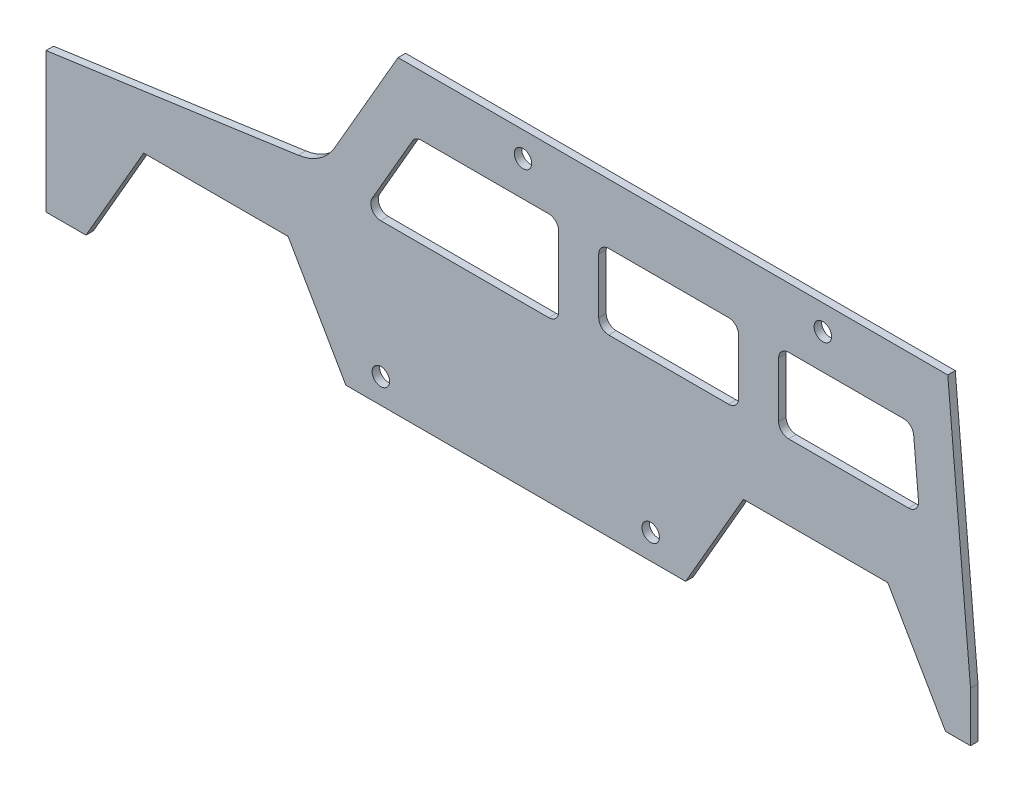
ISO-10303-21;
HEADER;
FILE_DESCRIPTION(('STEP AP214'),'2;1');
FILE_NAME('part.step','',(''),(''),'','','');
FILE_SCHEMA(('AUTOMOTIVE_DESIGN { 1 0 10303 214 1 1 1 1 }'));
ENDSEC;
DATA;
#1=APPLICATION_CONTEXT('core data for automotive mechanical design processes');
#2=APPLICATION_PROTOCOL_DEFINITION('international standard','automotive_design',2000,#1);
#3=PRODUCT_CONTEXT('',#1,'mechanical');
#4=PRODUCT('Part','Part','',(#3));
#5=PRODUCT_RELATED_PRODUCT_CATEGORY('part','',(#4));
#6=PRODUCT_DEFINITION_FORMATION('','',#4);
#7=PRODUCT_DEFINITION_CONTEXT('part definition',#1,'design');
#8=PRODUCT_DEFINITION('design','',#6,#7);
#9=PRODUCT_DEFINITION_SHAPE('','',#8);
#10=(LENGTH_UNIT() NAMED_UNIT(*) SI_UNIT(.MILLI.,.METRE.));
#11=(NAMED_UNIT(*) PLANE_ANGLE_UNIT() SI_UNIT($,.RADIAN.));
#12=(NAMED_UNIT(*) SI_UNIT($,.STERADIAN.) SOLID_ANGLE_UNIT());
#13=UNCERTAINTY_MEASURE_WITH_UNIT(LENGTH_MEASURE(1.E-05),#10,'distance_accuracy_value','');
#14=(GEOMETRIC_REPRESENTATION_CONTEXT(3) GLOBAL_UNCERTAINTY_ASSIGNED_CONTEXT((#13)) GLOBAL_UNIT_ASSIGNED_CONTEXT((#10,
#11,#12)) REPRESENTATION_CONTEXT('',''));
#15=CARTESIAN_POINT('',(0.,0.,0.));
#16=DIRECTION('',(0.,0.,1.));
#17=DIRECTION('',(1.,0.,0.));
#18=AXIS2_PLACEMENT_3D('',#15,#16,#17);
#19=CARTESIAN_POINT('',(49.0868907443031,44.9969883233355,1.5));
#20=DIRECTION('',(0.,0.,1.));
#21=DIRECTION('',(1.,0.,0.));
#22=AXIS2_PLACEMENT_3D('',#19,#20,#21);
#23=PLANE('',#22);
#24=DIRECTION('',(-1.,0.,0.));
#25=VECTOR('',#24,1.);
#26=CARTESIAN_POINT('',(112.599607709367,50.,1.5));
#27=LINE('',#26,#25);
#28=CARTESIAN_POINT('',(136.599607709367,50.,1.5));
#29=VERTEX_POINT('',#28);
#30=CARTESIAN_POINT('',(112.599607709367,50.,1.5));
#31=VERTEX_POINT('',#30);
#32=EDGE_CURVE('E373',#29,#31,#27,.T.);
#33=ORIENTED_EDGE('',*,*,#32,.F.);
#34=CARTESIAN_POINT('',(136.599607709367,48.,1.5));
#35=DIRECTION('',(0.,0.,1.));
#36=DIRECTION('',(1.,0.,0.));
#37=AXIS2_PLACEMENT_3D('',#34,#35,#36);
#38=CIRCLE('',#37,2.00000000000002);
#39=CARTESIAN_POINT('',(138.599607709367,48.,1.5));
#40=VERTEX_POINT('',#39);
#41=EDGE_CURVE('E371',#40,#29,#38,.T.);
#42=ORIENTED_EDGE('',*,*,#41,.F.);
#43=DIRECTION('',(0.,1.,0.));
#44=VECTOR('',#43,1.);
#45=CARTESIAN_POINT('',(138.599607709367,48.,1.5));
#46=LINE('',#45,#44);
#47=CARTESIAN_POINT('',(138.599607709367,37.,1.5));
#48=VERTEX_POINT('',#47);
#49=EDGE_CURVE('E387',#48,#40,#46,.T.);
#50=ORIENTED_EDGE('',*,*,#49,.F.);
#51=CARTESIAN_POINT('',(136.599607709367,37.,1.5));
#52=DIRECTION('',(0.,0.,1.));
#53=DIRECTION('',(1.,0.,0.));
#54=AXIS2_PLACEMENT_3D('',#51,#52,#53);
#55=CIRCLE('',#54,2.);
#56=CARTESIAN_POINT('',(136.599607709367,35.,1.5));
#57=VERTEX_POINT('',#56);
#58=EDGE_CURVE('E384',#57,#48,#55,.T.);
#59=ORIENTED_EDGE('',*,*,#58,.F.);
#60=DIRECTION('',(1.,0.,0.));
#61=VECTOR('',#60,1.);
#62=CARTESIAN_POINT('',(112.599607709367,35.,1.5));
#63=LINE('',#62,#61);
#64=CARTESIAN_POINT('',(112.599607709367,35.,1.5));
#65=VERTEX_POINT('',#64);
#66=EDGE_CURVE('E382',#65,#57,#63,.T.);
#67=ORIENTED_EDGE('',*,*,#66,.F.);
#68=CARTESIAN_POINT('',(112.599607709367,37.,1.5));
#69=DIRECTION('',(0.,0.,1.));
#70=DIRECTION('',(1.,0.,0.));
#71=AXIS2_PLACEMENT_3D('',#68,#69,#70);
#72=CIRCLE('',#71,1.99999999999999);
#73=CARTESIAN_POINT('',(110.599607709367,37.,1.5));
#74=VERTEX_POINT('',#73);
#75=EDGE_CURVE('E380',#74,#65,#72,.T.);
#76=ORIENTED_EDGE('',*,*,#75,.F.);
#77=DIRECTION('',(0.,-1.,0.));
#78=VECTOR('',#77,1.);
#79=CARTESIAN_POINT('',(110.599607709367,48.,1.5));
#80=LINE('',#79,#78);
#81=CARTESIAN_POINT('',(110.599607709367,48.,1.5));
#82=VERTEX_POINT('',#81);
#83=EDGE_CURVE('E378',#82,#74,#80,.T.);
#84=ORIENTED_EDGE('',*,*,#83,.F.);
#85=CARTESIAN_POINT('',(112.599607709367,48.,1.5));
#86=DIRECTION('',(0.,0.,1.));
#87=DIRECTION('',(1.,0.,0.));
#88=AXIS2_PLACEMENT_3D('',#85,#86,#87);
#89=CIRCLE('',#88,2.);
#90=EDGE_CURVE('E376',#31,#82,#89,.T.);
#91=ORIENTED_EDGE('',*,*,#90,.F.);
#92=EDGE_LOOP('',(#33,#42,#50,#59,#67,#76,#84,#91));
#93=FACE_BOUND('',#92,.T.);
#94=CARTESIAN_POINT('',(155.450589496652,57.,1.5));
#95=DIRECTION('',(0.,0.,1.));
#96=DIRECTION('',(1.,0.,0.));
#97=AXIS2_PLACEMENT_3D('',#94,#95,#96);
#98=CIRCLE('',#97,1.75000000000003);
#99=CARTESIAN_POINT('',(157.200589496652,57.,1.5));
#100=VERTEX_POINT('',#99);
#101=EDGE_CURVE('E489',#100,#100,#98,.T.);
#102=ORIENTED_EDGE('',*,*,#101,.F.);
#103=EDGE_LOOP('',(#102));
#104=FACE_BOUND('',#103,.T.);
#105=CARTESIAN_POINT('',(67.,4.99999999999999,1.5));
#106=DIRECTION('',(0.,0.,1.));
#107=DIRECTION('',(1.,0.,0.));
#108=AXIS2_PLACEMENT_3D('',#105,#106,#107);
#109=CIRCLE('',#108,1.75);
#110=CARTESIAN_POINT('',(68.75,4.99999999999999,1.5));
#111=VERTEX_POINT('',#110);
#112=EDGE_CURVE('E501',#111,#111,#109,.T.);
#113=ORIENTED_EDGE('',*,*,#112,.F.);
#114=EDGE_LOOP('',(#113));
#115=FACE_BOUND('',#114,.T.);
#116=DIRECTION('',(0.,-1.,0.));
#117=VECTOR('',#116,1.);
#118=CARTESIAN_POINT('',(0.,28.,1.5));
#119=LINE('',#118,#117);
#120=CARTESIAN_POINT('',(0.,28.,1.5));
#121=VERTEX_POINT('',#120);
#122=CARTESIAN_POINT('',(0.,0.,1.5));
#123=VERTEX_POINT('',#122);
#124=EDGE_CURVE('E513',#121,#123,#119,.T.);
#125=ORIENTED_EDGE('',*,*,#124,.T.);
#126=DIRECTION('',(1.,0.,0.));
#127=VECTOR('',#126,1.);
#128=CARTESIAN_POINT('',(0.,0.,1.5));
#129=LINE('',#128,#127);
#130=CARTESIAN_POINT('',(8.,0.,1.5));
#131=VERTEX_POINT('',#130);
#132=EDGE_CURVE('E516',#123,#131,#129,.T.);
#133=ORIENTED_EDGE('',*,*,#132,.T.);
#134=DIRECTION('',(0.499999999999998,0.86602540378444,0.));
#135=VECTOR('',#134,1.);
#136=CARTESIAN_POINT('',(8.,0.,1.5));
#137=LINE('',#136,#135);
#138=CARTESIAN_POINT('',(19.5470053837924,20.,1.5));
#139=VERTEX_POINT('',#138);
#140=EDGE_CURVE('E519',#131,#139,#137,.T.);
#141=ORIENTED_EDGE('',*,*,#140,.T.);
#142=DIRECTION('',(1.,0.,0.));
#143=VECTOR('',#142,1.);
#144=CARTESIAN_POINT('',(19.5470053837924,20.,1.5));
#145=LINE('',#144,#143);
#146=CARTESIAN_POINT('',(48.4529946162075,20.,1.5));
#147=VERTEX_POINT('',#146);
#148=EDGE_CURVE('E521',#139,#147,#145,.T.);
#149=ORIENTED_EDGE('',*,*,#148,.T.);
#150=DIRECTION('',(0.499999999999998,-0.86602540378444,0.));
#151=VECTOR('',#150,1.);
#152=CARTESIAN_POINT('',(48.4529946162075,20.,1.5));
#153=LINE('',#152,#151);
#154=CARTESIAN_POINT('',(60.,0.,1.5));
#155=VERTEX_POINT('',#154);
#156=EDGE_CURVE('E523',#147,#155,#153,.T.);
#157=ORIENTED_EDGE('',*,*,#156,.T.);
#158=DIRECTION('',(1.,0.,0.));
#159=VECTOR('',#158,1.);
#160=CARTESIAN_POINT('',(60.,0.,1.5));
#161=LINE('',#160,#159);
#162=CARTESIAN_POINT('',(128.,0.,1.5));
#163=VERTEX_POINT('',#162);
#164=EDGE_CURVE('E525',#155,#163,#161,.T.);
#165=ORIENTED_EDGE('',*,*,#164,.T.);
#166=DIRECTION('',(0.499999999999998,0.86602540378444,0.));
#167=VECTOR('',#166,1.);
#168=CARTESIAN_POINT('',(128.,0.,1.5));
#169=LINE('',#168,#167);
#170=CARTESIAN_POINT('',(139.547005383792,20.,1.5));
#171=VERTEX_POINT('',#170);
#172=EDGE_CURVE('E527',#163,#171,#169,.T.);
#173=ORIENTED_EDGE('',*,*,#172,.T.);
#174=DIRECTION('',(1.,0.,0.));
#175=VECTOR('',#174,1.);
#176=CARTESIAN_POINT('',(139.547005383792,20.,1.5));
#177=LINE('',#176,#175);
#178=CARTESIAN_POINT('',(168.452994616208,20.,1.5));
#179=VERTEX_POINT('',#178);
#180=EDGE_CURVE('E529',#171,#179,#177,.T.);
#181=ORIENTED_EDGE('',*,*,#180,.T.);
#182=DIRECTION('',(0.499999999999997,-0.866025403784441,0.));
#183=VECTOR('',#182,1.);
#184=CARTESIAN_POINT('',(168.452994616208,20.,1.5));
#185=LINE('',#184,#183);
#186=CARTESIAN_POINT('',(180.,0.,1.5));
#187=VERTEX_POINT('',#186);
#188=EDGE_CURVE('E531',#179,#187,#185,.T.);
#189=ORIENTED_EDGE('',*,*,#188,.T.);
#190=DIRECTION('',(1.,0.,0.));
#191=VECTOR('',#190,1.);
#192=CARTESIAN_POINT('',(180.,0.,1.5));
#193=LINE('',#192,#191);
#194=CARTESIAN_POINT('',(185.,0.,1.5));
#195=VERTEX_POINT('',#194);
#196=EDGE_CURVE('E533',#187,#195,#193,.T.);
#197=ORIENTED_EDGE('',*,*,#196,.T.);
#198=DIRECTION('',(0.,1.,0.));
#199=VECTOR('',#198,1.);
#200=CARTESIAN_POINT('',(185.,0.,1.5));
#201=LINE('',#200,#199);
#202=CARTESIAN_POINT('',(185.,10.,1.5));
#203=VERTEX_POINT('',#202);
#204=EDGE_CURVE('E535',#195,#203,#201,.T.);
#205=ORIENTED_EDGE('',*,*,#204,.T.);
#206=DIRECTION('',(-0.0871557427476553,0.996194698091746,0.));
#207=VECTOR('',#206,1.);
#208=CARTESIAN_POINT('',(185.,10.,1.5));
#209=LINE('',#208,#207);
#210=CARTESIAN_POINT('',(180.450589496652,62.,1.5));
#211=VERTEX_POINT('',#210);
#212=EDGE_CURVE('E537',#203,#211,#209,.T.);
#213=ORIENTED_EDGE('',*,*,#212,.T.);
#214=DIRECTION('',(-1.,0.,0.));
#215=VECTOR('',#214,1.);
#216=CARTESIAN_POINT('',(180.450589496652,62.,1.5));
#217=LINE('',#216,#215);
#218=CARTESIAN_POINT('',(70.4505894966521,62.,1.5));
#219=VERTEX_POINT('',#218);
#220=EDGE_CURVE('E539',#211,#219,#217,.T.);
#221=ORIENTED_EDGE('',*,*,#220,.T.);
#222=DIRECTION('',(-0.499999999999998,-0.86602540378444,0.));
#223=VECTOR('',#222,1.);
#224=CARTESIAN_POINT('',(70.4505894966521,62.,1.5));
#225=LINE('',#224,#223);
#226=CARTESIAN_POINT('',(57.7471447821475,39.9969883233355,1.5));
#227=VERTEX_POINT('',#226);
#228=EDGE_CURVE('E541',#219,#227,#225,.T.);
#229=ORIENTED_EDGE('',*,*,#228,.T.);
#230=CARTESIAN_POINT('',(49.0868907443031,44.9969883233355,1.5));
#231=DIRECTION('',(0.,0.,-1.));
#232=DIRECTION('',(1.,0.,0.));
#233=AXIS2_PLACEMENT_3D('',#230,#231,#232);
#234=CIRCLE('',#233,9.99999999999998);
#235=CARTESIAN_POINT('',(50.4786217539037,35.0943076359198,1.5));
#236=VERTEX_POINT('',#235);
#237=EDGE_CURVE('E543',#227,#236,#234,.T.);
#238=ORIENTED_EDGE('',*,*,#237,.T.);
#239=DIRECTION('',(-0.990268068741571,-0.139173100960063,0.));
#240=VECTOR('',#239,1.);
#241=CARTESIAN_POINT('',(50.4786217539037,35.0943076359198,1.5));
#242=LINE('',#241,#240);
#243=EDGE_CURVE('E545',#236,#121,#242,.T.);
#244=ORIENTED_EDGE('',*,*,#243,.T.);
#245=EDGE_LOOP('',(#125,#133,#141,#149,#157,#165,#173,#181,#189,#197,#205,#213,#221,#229,#238,#244));
#246=FACE_BOUND('',#245,.T.);
#247=CARTESIAN_POINT('',(121.,5.,1.5));
#248=DIRECTION('',(0.,0.,1.));
#249=DIRECTION('',(1.,0.,0.));
#250=AXIS2_PLACEMENT_3D('',#247,#248,#249);
#251=CIRCLE('',#250,1.75000000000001);
#252=CARTESIAN_POINT('',(122.75,5.,1.5));
#253=VERTEX_POINT('',#252);
#254=EDGE_CURVE('E507',#253,#253,#251,.T.);
#255=ORIENTED_EDGE('',*,*,#254,.F.);
#256=EDGE_LOOP('',(#255));
#257=FACE_BOUND('',#256,.T.);
#258=CARTESIAN_POINT('',(95.4505894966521,57.,1.5));
#259=DIRECTION('',(0.,0.,1.));
#260=DIRECTION('',(1.,0.,0.));
#261=AXIS2_PLACEMENT_3D('',#258,#259,#260);
#262=CIRCLE('',#261,1.75000000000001);
#263=CARTESIAN_POINT('',(97.2005894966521,57.,1.5));
#264=VERTEX_POINT('',#263);
#265=EDGE_CURVE('E495',#264,#264,#262,.T.);
#266=ORIENTED_EDGE('',*,*,#265,.F.);
#267=EDGE_LOOP('',(#266));
#268=FACE_BOUND('',#267,.T.);
#269=DIRECTION('',(-1.,0.,0.));
#270=VECTOR('',#269,1.);
#271=CARTESIAN_POINT('',(148.599607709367,50.,1.5));
#272=LINE('',#271,#270);
#273=CARTESIAN_POINT('',(171.637232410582,50.,1.5));
#274=VERTEX_POINT('',#273);
#275=CARTESIAN_POINT('',(148.599607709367,50.,1.5));
#276=VERTEX_POINT('',#275);
#277=EDGE_CURVE('E432',#274,#276,#272,.T.);
#278=ORIENTED_EDGE('',*,*,#277,.F.);
#279=CARTESIAN_POINT('',(171.637232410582,48.,1.5));
#280=DIRECTION('',(0.,0.,1.));
#281=DIRECTION('',(1.,0.,0.));
#282=AXIS2_PLACEMENT_3D('',#279,#280,#281);
#283=CIRCLE('',#282,2.);
#284=CARTESIAN_POINT('',(173.629621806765,48.1743114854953,1.5));
#285=VERTEX_POINT('',#284);
#286=EDGE_CURVE('E430',#285,#274,#283,.T.);
#287=ORIENTED_EDGE('',*,*,#286,.F.);
#288=DIRECTION('',(-0.0871557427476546,0.996194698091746,0.));
#289=VECTOR('',#288,1.);
#290=CARTESIAN_POINT('',(173.629621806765,48.1743114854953,1.5));
#291=LINE('',#290,#289);
#292=CARTESIAN_POINT('',(174.59199710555,37.1743114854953,1.5));
#293=VERTEX_POINT('',#292);
#294=EDGE_CURVE('E446',#293,#285,#291,.T.);
#295=ORIENTED_EDGE('',*,*,#294,.F.);
#296=CARTESIAN_POINT('',(172.599607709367,37.,1.5));
#297=DIRECTION('',(0.,0.,1.));
#298=DIRECTION('',(1.,0.,0.));
#299=AXIS2_PLACEMENT_3D('',#296,#297,#298);
#300=CIRCLE('',#299,1.99999999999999);
#301=CARTESIAN_POINT('',(172.599607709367,35.,1.5));
#302=VERTEX_POINT('',#301);
#303=EDGE_CURVE('E443',#302,#293,#300,.T.);
#304=ORIENTED_EDGE('',*,*,#303,.F.);
#305=DIRECTION('',(1.,0.,0.));
#306=VECTOR('',#305,1.);
#307=CARTESIAN_POINT('',(148.599607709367,35.,1.5));
#308=LINE('',#307,#306);
#309=CARTESIAN_POINT('',(148.599607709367,35.,1.5));
#310=VERTEX_POINT('',#309);
#311=EDGE_CURVE('E441',#310,#302,#308,.T.);
#312=ORIENTED_EDGE('',*,*,#311,.F.);
#313=CARTESIAN_POINT('',(148.599607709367,37.,1.5));
#314=DIRECTION('',(0.,0.,1.));
#315=DIRECTION('',(1.,0.,0.));
#316=AXIS2_PLACEMENT_3D('',#313,#314,#315);
#317=CIRCLE('',#316,2.00000000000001);
#318=CARTESIAN_POINT('',(146.599607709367,37.,1.5));
#319=VERTEX_POINT('',#318);
#320=EDGE_CURVE('E439',#319,#310,#317,.T.);
#321=ORIENTED_EDGE('',*,*,#320,.F.);
#322=DIRECTION('',(0.,-1.,0.));
#323=VECTOR('',#322,1.);
#324=CARTESIAN_POINT('',(146.599607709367,48.,1.5));
#325=LINE('',#324,#323);
#326=CARTESIAN_POINT('',(146.599607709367,48.,1.5));
#327=VERTEX_POINT('',#326);
#328=EDGE_CURVE('E437',#327,#319,#325,.T.);
#329=ORIENTED_EDGE('',*,*,#328,.F.);
#330=CARTESIAN_POINT('',(148.599607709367,48.,1.5));
#331=DIRECTION('',(0.,0.,1.));
#332=DIRECTION('',(1.,0.,0.));
#333=AXIS2_PLACEMENT_3D('',#330,#331,#332);
#334=CIRCLE('',#333,2.);
#335=EDGE_CURVE('E435',#276,#327,#334,.T.);
#336=ORIENTED_EDGE('',*,*,#335,.F.);
#337=EDGE_LOOP('',(#278,#287,#295,#304,#312,#321,#329,#336));
#338=FACE_BOUND('',#337,.T.);
#339=DIRECTION('',(-1.,0.,0.));
#340=VECTOR('',#339,1.);
#341=CARTESIAN_POINT('',(75.0693916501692,50.,1.5));
#342=LINE('',#341,#340);
#343=CARTESIAN_POINT('',(100.599607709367,50.,1.5));
#344=VERTEX_POINT('',#343);
#345=CARTESIAN_POINT('',(75.0693916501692,50.,1.5));
#346=VERTEX_POINT('',#345);
#347=EDGE_CURVE('E314',#344,#346,#342,.T.);
#348=ORIENTED_EDGE('',*,*,#347,.F.);
#349=CARTESIAN_POINT('',(100.599607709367,48.,1.5));
#350=DIRECTION('',(0.,0.,1.));
#351=DIRECTION('',(1.,0.,0.));
#352=AXIS2_PLACEMENT_3D('',#349,#350,#351);
#353=CIRCLE('',#352,2.);
#354=CARTESIAN_POINT('',(102.599607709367,48.,1.5));
#355=VERTEX_POINT('',#354);
#356=EDGE_CURVE('E306',#355,#344,#353,.T.);
#357=ORIENTED_EDGE('',*,*,#356,.F.);
#358=DIRECTION('',(0.,1.,0.));
#359=VECTOR('',#358,1.);
#360=CARTESIAN_POINT('',(102.599607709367,48.,1.5));
#361=LINE('',#360,#359);
#362=CARTESIAN_POINT('',(102.599607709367,34.,1.5));
#363=VERTEX_POINT('',#362);
#364=EDGE_CURVE('E339',#363,#355,#361,.T.);
#365=ORIENTED_EDGE('',*,*,#364,.F.);
#366=CARTESIAN_POINT('',(100.599607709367,34.,1.5));
#367=DIRECTION('',(0.,0.,1.));
#368=DIRECTION('',(1.,0.,0.));
#369=AXIS2_PLACEMENT_3D('',#366,#367,#368);
#370=CIRCLE('',#369,1.99999999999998);
#371=CARTESIAN_POINT('',(100.599607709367,32.,1.5));
#372=VERTEX_POINT('',#371);
#373=EDGE_CURVE('E337',#372,#363,#370,.T.);
#374=ORIENTED_EDGE('',*,*,#373,.F.);
#375=DIRECTION('',(1.,0.,0.));
#376=VECTOR('',#375,1.);
#377=CARTESIAN_POINT('',(66.9864878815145,32.,1.5));
#378=LINE('',#377,#376);
#379=CARTESIAN_POINT('',(66.9864878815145,32.,1.5));
#380=VERTEX_POINT('',#379);
#381=EDGE_CURVE('E335',#380,#372,#378,.T.);
#382=ORIENTED_EDGE('',*,*,#381,.F.);
#383=CARTESIAN_POINT('',(66.9864878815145,34.,1.5));
#384=DIRECTION('',(0.,0.,1.));
#385=DIRECTION('',(1.,0.,0.));
#386=AXIS2_PLACEMENT_3D('',#383,#384,#385);
#387=CIRCLE('',#386,1.99999999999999);
#388=CARTESIAN_POINT('',(65.2544370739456,35.,1.5));
#389=VERTEX_POINT('',#388);
#390=EDGE_CURVE('E333',#389,#380,#387,.T.);
#391=ORIENTED_EDGE('',*,*,#390,.F.);
#392=DIRECTION('',(-0.499999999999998,-0.86602540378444,0.));
#393=VECTOR('',#392,1.);
#394=CARTESIAN_POINT('',(73.3373408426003,49.,1.5));
#395=LINE('',#394,#393);
#396=CARTESIAN_POINT('',(73.3373408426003,49.,1.5));
#397=VERTEX_POINT('',#396);
#398=EDGE_CURVE('E329',#397,#389,#395,.T.);
#399=ORIENTED_EDGE('',*,*,#398,.F.);
#400=CARTESIAN_POINT('',(75.0693916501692,48.,1.5));
#401=DIRECTION('',(0.,0.,1.));
#402=DIRECTION('',(1.,0.,0.));
#403=AXIS2_PLACEMENT_3D('',#400,#401,#402);
#404=CIRCLE('',#403,1.99999999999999);
#405=EDGE_CURVE('E327',#346,#397,#404,.T.);
#406=ORIENTED_EDGE('',*,*,#405,.F.);
#407=EDGE_LOOP('',(#348,#357,#365,#374,#382,#391,#399,#406));
#408=FACE_BOUND('',#407,.T.);
#409=ADVANCED_FACE('F49',(#93,#104,#115,#246,#257,#268,#338,#408),#23,.T.);
#410=CARTESIAN_POINT('',(49.0868907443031,44.9969883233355,0.));
#411=DIRECTION('',(0.,0.,1.));
#412=DIRECTION('',(1.,0.,0.));
#413=AXIS2_PLACEMENT_3D('',#410,#411,#412);
#414=PLANE('',#413);
#415=CARTESIAN_POINT('',(136.599607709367,48.,0.));
#416=DIRECTION('',(0.,0.,1.));
#417=DIRECTION('',(1.,0.,0.));
#418=AXIS2_PLACEMENT_3D('',#415,#416,#417);
#419=CIRCLE('',#418,2.00000000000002);
#420=CARTESIAN_POINT('',(138.599607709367,48.,0.));
#421=VERTEX_POINT('',#420);
#422=CARTESIAN_POINT('',(136.599607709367,50.,0.));
#423=VERTEX_POINT('',#422);
#424=EDGE_CURVE('E322',#421,#423,#419,.T.);
#425=ORIENTED_EDGE('',*,*,#424,.T.);
#426=DIRECTION('',(-1.,0.,0.));
#427=VECTOR('',#426,1.);
#428=CARTESIAN_POINT('',(112.599607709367,50.,0.));
#429=LINE('',#428,#427);
#430=CARTESIAN_POINT('',(112.599607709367,50.,0.));
#431=VERTEX_POINT('',#430);
#432=EDGE_CURVE('E392',#423,#431,#429,.T.);
#433=ORIENTED_EDGE('',*,*,#432,.T.);
#434=CARTESIAN_POINT('',(112.599607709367,48.,0.));
#435=DIRECTION('',(0.,0.,1.));
#436=DIRECTION('',(1.,0.,0.));
#437=AXIS2_PLACEMENT_3D('',#434,#435,#436);
#438=CIRCLE('',#437,2.);
#439=CARTESIAN_POINT('',(110.599607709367,48.,0.));
#440=VERTEX_POINT('',#439);
#441=EDGE_CURVE('E395',#431,#440,#438,.T.);
#442=ORIENTED_EDGE('',*,*,#441,.T.);
#443=DIRECTION('',(0.,-1.,0.));
#444=VECTOR('',#443,1.);
#445=CARTESIAN_POINT('',(110.599607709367,48.,0.));
#446=LINE('',#445,#444);
#447=CARTESIAN_POINT('',(110.599607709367,37.,0.));
#448=VERTEX_POINT('',#447);
#449=EDGE_CURVE('E398',#440,#448,#446,.T.);
#450=ORIENTED_EDGE('',*,*,#449,.T.);
#451=CARTESIAN_POINT('',(112.599607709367,37.,0.));
#452=DIRECTION('',(0.,0.,1.));
#453=DIRECTION('',(1.,0.,0.));
#454=AXIS2_PLACEMENT_3D('',#451,#452,#453);
#455=CIRCLE('',#454,1.99999999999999);
#456=CARTESIAN_POINT('',(112.599607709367,35.,0.));
#457=VERTEX_POINT('',#456);
#458=EDGE_CURVE('E401',#448,#457,#455,.T.);
#459=ORIENTED_EDGE('',*,*,#458,.T.);
#460=DIRECTION('',(1.,0.,0.));
#461=VECTOR('',#460,1.);
#462=CARTESIAN_POINT('',(112.599607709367,35.,0.));
#463=LINE('',#462,#461);
#464=CARTESIAN_POINT('',(136.599607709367,35.,0.));
#465=VERTEX_POINT('',#464);
#466=EDGE_CURVE('E404',#457,#465,#463,.T.);
#467=ORIENTED_EDGE('',*,*,#466,.T.);
#468=CARTESIAN_POINT('',(136.599607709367,37.,0.));
#469=DIRECTION('',(0.,0.,1.));
#470=DIRECTION('',(1.,0.,0.));
#471=AXIS2_PLACEMENT_3D('',#468,#469,#470);
#472=CIRCLE('',#471,2.);
#473=CARTESIAN_POINT('',(138.599607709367,37.,0.));
#474=VERTEX_POINT('',#473);
#475=EDGE_CURVE('E407',#465,#474,#472,.T.);
#476=ORIENTED_EDGE('',*,*,#475,.T.);
#477=DIRECTION('',(0.,1.,0.));
#478=VECTOR('',#477,1.);
#479=CARTESIAN_POINT('',(138.599607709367,48.,0.));
#480=LINE('',#479,#478);
#481=EDGE_CURVE('E374',#474,#421,#480,.T.);
#482=ORIENTED_EDGE('',*,*,#481,.T.);
#483=EDGE_LOOP('',(#425,#433,#442,#450,#459,#467,#476,#482));
#484=FACE_BOUND('',#483,.T.);
#485=CARTESIAN_POINT('',(155.450589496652,57.,0.));
#486=DIRECTION('',(0.,0.,1.));
#487=DIRECTION('',(1.,0.,0.));
#488=AXIS2_PLACEMENT_3D('',#485,#486,#487);
#489=CIRCLE('',#488,1.75000000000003);
#490=CARTESIAN_POINT('',(157.200589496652,57.,0.));
#491=VERTEX_POINT('',#490);
#492=EDGE_CURVE('E488',#491,#491,#489,.T.);
#493=ORIENTED_EDGE('',*,*,#492,.T.);
#494=EDGE_LOOP('',(#493));
#495=FACE_BOUND('',#494,.T.);
#496=CARTESIAN_POINT('',(67.,4.99999999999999,0.));
#497=DIRECTION('',(0.,0.,1.));
#498=DIRECTION('',(1.,0.,0.));
#499=AXIS2_PLACEMENT_3D('',#496,#497,#498);
#500=CIRCLE('',#499,1.75);
#501=CARTESIAN_POINT('',(68.75,4.99999999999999,0.));
#502=VERTEX_POINT('',#501);
#503=EDGE_CURVE('E498',#502,#502,#500,.T.);
#504=ORIENTED_EDGE('',*,*,#503,.T.);
#505=EDGE_LOOP('',(#504));
#506=FACE_BOUND('',#505,.T.);
#507=DIRECTION('',(0.,-1.,0.));
#508=VECTOR('',#507,1.);
#509=CARTESIAN_POINT('',(0.,28.,0.));
#510=LINE('',#509,#508);
#511=CARTESIAN_POINT('',(0.,28.,0.));
#512=VERTEX_POINT('',#511);
#513=CARTESIAN_POINT('',(0.,0.,0.));
#514=VERTEX_POINT('',#513);
#515=EDGE_CURVE('E510',#512,#514,#510,.T.);
#516=ORIENTED_EDGE('',*,*,#515,.F.);
#517=DIRECTION('',(-0.990268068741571,-0.139173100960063,0.));
#518=VECTOR('',#517,1.);
#519=CARTESIAN_POINT('',(50.4786217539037,35.0943076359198,0.));
#520=LINE('',#519,#518);
#521=CARTESIAN_POINT('',(50.4786217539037,35.0943076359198,0.));
#522=VERTEX_POINT('',#521);
#523=EDGE_CURVE('E517',#522,#512,#520,.T.);
#524=ORIENTED_EDGE('',*,*,#523,.F.);
#525=CARTESIAN_POINT('',(49.0868907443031,44.9969883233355,0.));
#526=DIRECTION('',(0.,0.,-1.));
#527=DIRECTION('',(1.,0.,0.));
#528=AXIS2_PLACEMENT_3D('',#525,#526,#527);
#529=CIRCLE('',#528,9.99999999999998);
#530=CARTESIAN_POINT('',(57.7471447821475,39.9969883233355,0.));
#531=VERTEX_POINT('',#530);
#532=EDGE_CURVE('E576',#531,#522,#529,.T.);
#533=ORIENTED_EDGE('',*,*,#532,.F.);
#534=DIRECTION('',(-0.499999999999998,-0.86602540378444,0.));
#535=VECTOR('',#534,1.);
#536=CARTESIAN_POINT('',(70.4505894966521,62.,0.));
#537=LINE('',#536,#535);
#538=CARTESIAN_POINT('',(70.4505894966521,62.,0.));
#539=VERTEX_POINT('',#538);
#540=EDGE_CURVE('E574',#539,#531,#537,.T.);
#541=ORIENTED_EDGE('',*,*,#540,.F.);
#542=DIRECTION('',(-1.,0.,0.));
#543=VECTOR('',#542,1.);
#544=CARTESIAN_POINT('',(180.450589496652,62.,0.));
#545=LINE('',#544,#543);
#546=CARTESIAN_POINT('',(180.450589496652,62.,0.));
#547=VERTEX_POINT('',#546);
#548=EDGE_CURVE('E572',#547,#539,#545,.T.);
#549=ORIENTED_EDGE('',*,*,#548,.F.);
#550=DIRECTION('',(-0.0871557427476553,0.996194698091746,0.));
#551=VECTOR('',#550,1.);
#552=CARTESIAN_POINT('',(185.,10.,0.));
#553=LINE('',#552,#551);
#554=CARTESIAN_POINT('',(185.,10.,0.));
#555=VERTEX_POINT('',#554);
#556=EDGE_CURVE('E570',#555,#547,#553,.T.);
#557=ORIENTED_EDGE('',*,*,#556,.F.);
#558=DIRECTION('',(0.,1.,0.));
#559=VECTOR('',#558,1.);
#560=CARTESIAN_POINT('',(185.,0.,0.));
#561=LINE('',#560,#559);
#562=CARTESIAN_POINT('',(185.,0.,0.));
#563=VERTEX_POINT('',#562);
#564=EDGE_CURVE('E568',#563,#555,#561,.T.);
#565=ORIENTED_EDGE('',*,*,#564,.F.);
#566=DIRECTION('',(1.,0.,0.));
#567=VECTOR('',#566,1.);
#568=CARTESIAN_POINT('',(180.,0.,0.));
#569=LINE('',#568,#567);
#570=CARTESIAN_POINT('',(180.,0.,0.));
#571=VERTEX_POINT('',#570);
#572=EDGE_CURVE('E566',#571,#563,#569,.T.);
#573=ORIENTED_EDGE('',*,*,#572,.F.);
#574=DIRECTION('',(0.499999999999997,-0.866025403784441,0.));
#575=VECTOR('',#574,1.);
#576=CARTESIAN_POINT('',(168.452994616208,20.,0.));
#577=LINE('',#576,#575);
#578=CARTESIAN_POINT('',(168.452994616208,20.,0.));
#579=VERTEX_POINT('',#578);
#580=EDGE_CURVE('E564',#579,#571,#577,.T.);
#581=ORIENTED_EDGE('',*,*,#580,.F.);
#582=DIRECTION('',(1.,0.,0.));
#583=VECTOR('',#582,1.);
#584=CARTESIAN_POINT('',(139.547005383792,20.,0.));
#585=LINE('',#584,#583);
#586=CARTESIAN_POINT('',(139.547005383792,20.,0.));
#587=VERTEX_POINT('',#586);
#588=EDGE_CURVE('E562',#587,#579,#585,.T.);
#589=ORIENTED_EDGE('',*,*,#588,.F.);
#590=DIRECTION('',(0.499999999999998,0.86602540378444,0.));
#591=VECTOR('',#590,1.);
#592=CARTESIAN_POINT('',(128.,0.,0.));
#593=LINE('',#592,#591);
#594=CARTESIAN_POINT('',(128.,0.,0.));
#595=VERTEX_POINT('',#594);
#596=EDGE_CURVE('E560',#595,#587,#593,.T.);
#597=ORIENTED_EDGE('',*,*,#596,.F.);
#598=DIRECTION('',(1.,0.,0.));
#599=VECTOR('',#598,1.);
#600=CARTESIAN_POINT('',(60.,0.,0.));
#601=LINE('',#600,#599);
#602=CARTESIAN_POINT('',(60.,0.,0.));
#603=VERTEX_POINT('',#602);
#604=EDGE_CURVE('E558',#603,#595,#601,.T.);
#605=ORIENTED_EDGE('',*,*,#604,.F.);
#606=DIRECTION('',(0.499999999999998,-0.86602540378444,0.));
#607=VECTOR('',#606,1.);
#608=CARTESIAN_POINT('',(48.4529946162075,20.,0.));
#609=LINE('',#608,#607);
#610=CARTESIAN_POINT('',(48.4529946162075,20.,0.));
#611=VERTEX_POINT('',#610);
#612=EDGE_CURVE('E556',#611,#603,#609,.T.);
#613=ORIENTED_EDGE('',*,*,#612,.F.);
#614=DIRECTION('',(1.,0.,0.));
#615=VECTOR('',#614,1.);
#616=CARTESIAN_POINT('',(19.5470053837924,20.,0.));
#617=LINE('',#616,#615);
#618=CARTESIAN_POINT('',(19.5470053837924,20.,0.));
#619=VERTEX_POINT('',#618);
#620=EDGE_CURVE('E554',#619,#611,#617,.T.);
#621=ORIENTED_EDGE('',*,*,#620,.F.);
#622=DIRECTION('',(0.499999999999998,0.86602540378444,0.));
#623=VECTOR('',#622,1.);
#624=CARTESIAN_POINT('',(8.,0.,0.));
#625=LINE('',#624,#623);
#626=CARTESIAN_POINT('',(8.,0.,0.));
#627=VERTEX_POINT('',#626);
#628=EDGE_CURVE('E552',#627,#619,#625,.T.);
#629=ORIENTED_EDGE('',*,*,#628,.F.);
#630=DIRECTION('',(1.,0.,0.));
#631=VECTOR('',#630,1.);
#632=CARTESIAN_POINT('',(0.,0.,0.));
#633=LINE('',#632,#631);
#634=EDGE_CURVE('E550',#514,#627,#633,.T.);
#635=ORIENTED_EDGE('',*,*,#634,.F.);
#636=EDGE_LOOP('',(#516,#524,#533,#541,#549,#557,#565,#573,#581,#589,#597,#605,#613,#621,#629,#635));
#637=FACE_BOUND('',#636,.T.);
#638=CARTESIAN_POINT('',(121.,5.,0.));
#639=DIRECTION('',(0.,0.,1.));
#640=DIRECTION('',(1.,0.,0.));
#641=AXIS2_PLACEMENT_3D('',#638,#639,#640);
#642=CIRCLE('',#641,1.75000000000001);
#643=CARTESIAN_POINT('',(122.75,5.,0.));
#644=VERTEX_POINT('',#643);
#645=EDGE_CURVE('E504',#644,#644,#642,.T.);
#646=ORIENTED_EDGE('',*,*,#645,.T.);
#647=EDGE_LOOP('',(#646));
#648=FACE_BOUND('',#647,.T.);
#649=CARTESIAN_POINT('',(95.4505894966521,57.,0.));
#650=DIRECTION('',(0.,0.,1.));
#651=DIRECTION('',(1.,0.,0.));
#652=AXIS2_PLACEMENT_3D('',#649,#650,#651);
#653=CIRCLE('',#652,1.75000000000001);
#654=CARTESIAN_POINT('',(97.2005894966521,57.,0.));
#655=VERTEX_POINT('',#654);
#656=EDGE_CURVE('E492',#655,#655,#653,.T.);
#657=ORIENTED_EDGE('',*,*,#656,.T.);
#658=EDGE_LOOP('',(#657));
#659=FACE_BOUND('',#658,.T.);
#660=CARTESIAN_POINT('',(171.637232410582,48.,0.));
#661=DIRECTION('',(0.,0.,1.));
#662=DIRECTION('',(1.,0.,0.));
#663=AXIS2_PLACEMENT_3D('',#660,#661,#662);
#664=CIRCLE('',#663,2.);
#665=CARTESIAN_POINT('',(173.629621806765,48.1743114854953,0.));
#666=VERTEX_POINT('',#665);
#667=CARTESIAN_POINT('',(171.637232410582,50.,0.));
#668=VERTEX_POINT('',#667);
#669=EDGE_CURVE('E429',#666,#668,#664,.T.);
#670=ORIENTED_EDGE('',*,*,#669,.T.);
#671=DIRECTION('',(-1.,0.,0.));
#672=VECTOR('',#671,1.);
#673=CARTESIAN_POINT('',(148.599607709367,50.,0.));
#674=LINE('',#673,#672);
#675=CARTESIAN_POINT('',(148.599607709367,50.,0.));
#676=VERTEX_POINT('',#675);
#677=EDGE_CURVE('E451',#668,#676,#674,.T.);
#678=ORIENTED_EDGE('',*,*,#677,.T.);
#679=CARTESIAN_POINT('',(148.599607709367,48.,0.));
#680=DIRECTION('',(0.,0.,1.));
#681=DIRECTION('',(1.,0.,0.));
#682=AXIS2_PLACEMENT_3D('',#679,#680,#681);
#683=CIRCLE('',#682,2.);
#684=CARTESIAN_POINT('',(146.599607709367,48.,0.));
#685=VERTEX_POINT('',#684);
#686=EDGE_CURVE('E454',#676,#685,#683,.T.);
#687=ORIENTED_EDGE('',*,*,#686,.T.);
#688=DIRECTION('',(0.,-1.,0.));
#689=VECTOR('',#688,1.);
#690=CARTESIAN_POINT('',(146.599607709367,48.,0.));
#691=LINE('',#690,#689);
#692=CARTESIAN_POINT('',(146.599607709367,37.,0.));
#693=VERTEX_POINT('',#692);
#694=EDGE_CURVE('E457',#685,#693,#691,.T.);
#695=ORIENTED_EDGE('',*,*,#694,.T.);
#696=CARTESIAN_POINT('',(148.599607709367,37.,0.));
#697=DIRECTION('',(0.,0.,1.));
#698=DIRECTION('',(1.,0.,0.));
#699=AXIS2_PLACEMENT_3D('',#696,#697,#698);
#700=CIRCLE('',#699,2.00000000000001);
#701=CARTESIAN_POINT('',(148.599607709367,35.,0.));
#702=VERTEX_POINT('',#701);
#703=EDGE_CURVE('E460',#693,#702,#700,.T.);
#704=ORIENTED_EDGE('',*,*,#703,.T.);
#705=DIRECTION('',(1.,0.,0.));
#706=VECTOR('',#705,1.);
#707=CARTESIAN_POINT('',(148.599607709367,35.,0.));
#708=LINE('',#707,#706);
#709=CARTESIAN_POINT('',(172.599607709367,35.,0.));
#710=VERTEX_POINT('',#709);
#711=EDGE_CURVE('E463',#702,#710,#708,.T.);
#712=ORIENTED_EDGE('',*,*,#711,.T.);
#713=CARTESIAN_POINT('',(172.599607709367,37.,0.));
#714=DIRECTION('',(0.,0.,1.));
#715=DIRECTION('',(1.,0.,0.));
#716=AXIS2_PLACEMENT_3D('',#713,#714,#715);
#717=CIRCLE('',#716,1.99999999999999);
#718=CARTESIAN_POINT('',(174.59199710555,37.1743114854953,0.));
#719=VERTEX_POINT('',#718);
#720=EDGE_CURVE('E466',#710,#719,#717,.T.);
#721=ORIENTED_EDGE('',*,*,#720,.T.);
#722=DIRECTION('',(-0.0871557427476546,0.996194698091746,0.));
#723=VECTOR('',#722,1.);
#724=CARTESIAN_POINT('',(173.629621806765,48.1743114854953,0.));
#725=LINE('',#724,#723);
#726=EDGE_CURVE('E433',#719,#666,#725,.T.);
#727=ORIENTED_EDGE('',*,*,#726,.T.);
#728=EDGE_LOOP('',(#670,#678,#687,#695,#704,#712,#721,#727));
#729=FACE_BOUND('',#728,.T.);
#730=CARTESIAN_POINT('',(100.599607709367,48.,0.));
#731=DIRECTION('',(0.,0.,1.));
#732=DIRECTION('',(1.,0.,0.));
#733=AXIS2_PLACEMENT_3D('',#730,#731,#732);
#734=CIRCLE('',#733,2.);
#735=CARTESIAN_POINT('',(102.599607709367,48.,0.));
#736=VERTEX_POINT('',#735);
#737=CARTESIAN_POINT('',(100.599607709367,50.,0.));
#738=VERTEX_POINT('',#737);
#739=EDGE_CURVE('E72',#736,#738,#734,.T.);
#740=ORIENTED_EDGE('',*,*,#739,.T.);
#741=DIRECTION('',(-1.,0.,0.));
#742=VECTOR('',#741,1.);
#743=CARTESIAN_POINT('',(75.0693916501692,50.,0.));
#744=LINE('',#743,#742);
#745=CARTESIAN_POINT('',(75.0693916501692,50.,0.));
#746=VERTEX_POINT('',#745);
#747=EDGE_CURVE('E321',#738,#746,#744,.T.);
#748=ORIENTED_EDGE('',*,*,#747,.T.);
#749=CARTESIAN_POINT('',(75.0693916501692,48.,0.));
#750=DIRECTION('',(0.,0.,1.));
#751=DIRECTION('',(1.,0.,0.));
#752=AXIS2_PLACEMENT_3D('',#749,#750,#751);
#753=CIRCLE('',#752,1.99999999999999);
#754=CARTESIAN_POINT('',(73.3373408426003,49.,0.));
#755=VERTEX_POINT('',#754);
#756=EDGE_CURVE('E343',#746,#755,#753,.T.);
#757=ORIENTED_EDGE('',*,*,#756,.T.);
#758=DIRECTION('',(-0.499999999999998,-0.86602540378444,0.));
#759=VECTOR('',#758,1.);
#760=CARTESIAN_POINT('',(73.3373408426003,49.,0.));
#761=LINE('',#760,#759);
#762=CARTESIAN_POINT('',(65.2544370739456,35.,0.));
#763=VERTEX_POINT('',#762);
#764=EDGE_CURVE('E346',#755,#763,#761,.T.);
#765=ORIENTED_EDGE('',*,*,#764,.T.);
#766=CARTESIAN_POINT('',(66.9864878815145,34.,0.));
#767=DIRECTION('',(0.,0.,1.));
#768=DIRECTION('',(1.,0.,0.));
#769=AXIS2_PLACEMENT_3D('',#766,#767,#768);
#770=CIRCLE('',#769,1.99999999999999);
#771=CARTESIAN_POINT('',(66.9864878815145,32.,0.));
#772=VERTEX_POINT('',#771);
#773=EDGE_CURVE('E349',#763,#772,#770,.T.);
#774=ORIENTED_EDGE('',*,*,#773,.T.);
#775=DIRECTION('',(1.,0.,0.));
#776=VECTOR('',#775,1.);
#777=CARTESIAN_POINT('',(66.9864878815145,32.,0.));
#778=LINE('',#777,#776);
#779=CARTESIAN_POINT('',(100.599607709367,32.,0.));
#780=VERTEX_POINT('',#779);
#781=EDGE_CURVE('E352',#772,#780,#778,.T.);
#782=ORIENTED_EDGE('',*,*,#781,.T.);
#783=CARTESIAN_POINT('',(100.599607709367,34.,0.));
#784=DIRECTION('',(0.,0.,1.));
#785=DIRECTION('',(1.,0.,0.));
#786=AXIS2_PLACEMENT_3D('',#783,#784,#785);
#787=CIRCLE('',#786,1.99999999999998);
#788=CARTESIAN_POINT('',(102.599607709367,34.,0.));
#789=VERTEX_POINT('',#788);
#790=EDGE_CURVE('E355',#780,#789,#787,.T.);
#791=ORIENTED_EDGE('',*,*,#790,.T.);
#792=DIRECTION('',(0.,1.,0.));
#793=VECTOR('',#792,1.);
#794=CARTESIAN_POINT('',(102.599607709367,48.,0.));
#795=LINE('',#794,#793);
#796=EDGE_CURVE('E315',#789,#736,#795,.T.);
#797=ORIENTED_EDGE('',*,*,#796,.T.);
#798=EDGE_LOOP('',(#740,#748,#757,#765,#774,#782,#791,#797));
#799=FACE_BOUND('',#798,.T.);
#800=ADVANCED_FACE('F630',(#484,#495,#506,#637,#648,#659,#729,#799),#414,.F.);
#801=CARTESIAN_POINT('',(0.,28.,1.5));
#802=DIRECTION('',(1.,0.,0.));
#803=DIRECTION('',(0.,0.,-1.));
#804=AXIS2_PLACEMENT_3D('',#801,#802,#803);
#805=PLANE('',#804);
#806=ORIENTED_EDGE('',*,*,#515,.T.);
#807=DIRECTION('',(0.,0.,-1.));
#808=VECTOR('',#807,1.);
#809=CARTESIAN_POINT('',(0.,0.,1.5));
#810=LINE('',#809,#808);
#811=EDGE_CURVE('E13',#123,#514,#810,.T.);
#812=ORIENTED_EDGE('',*,*,#811,.F.);
#813=ORIENTED_EDGE('',*,*,#124,.F.);
#814=DIRECTION('',(0.,0.,-1.));
#815=VECTOR('',#814,1.);
#816=CARTESIAN_POINT('',(0.,28.,1.5));
#817=LINE('',#816,#815);
#818=EDGE_CURVE('E547',#121,#512,#817,.T.);
#819=ORIENTED_EDGE('',*,*,#818,.T.);
#820=EDGE_LOOP('',(#806,#812,#813,#819));
#821=FACE_BOUND('',#820,.T.);
#822=ADVANCED_FACE('F51',(#821),#805,.F.);
#823=CARTESIAN_POINT('',(0.,0.,1.5));
#824=DIRECTION('',(0.,1.,0.));
#825=DIRECTION('',(0.,0.,1.));
#826=AXIS2_PLACEMENT_3D('',#823,#824,#825);
#827=PLANE('',#826);
#828=ORIENTED_EDGE('',*,*,#634,.T.);
#829=DIRECTION('',(0.,0.,-1.));
#830=VECTOR('',#829,1.);
#831=CARTESIAN_POINT('',(8.,0.,1.5));
#832=LINE('',#831,#830);
#833=EDGE_CURVE('E57',#131,#627,#832,.T.);
#834=ORIENTED_EDGE('',*,*,#833,.F.);
#835=ORIENTED_EDGE('',*,*,#132,.F.);
#836=ORIENTED_EDGE('',*,*,#811,.T.);
#837=EDGE_LOOP('',(#828,#834,#835,#836));
#838=FACE_BOUND('',#837,.T.);
#839=ADVANCED_FACE('F648',(#838),#827,.F.);
#840=CARTESIAN_POINT('',(8.,0.,1.5));
#841=DIRECTION('',(-0.86602540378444,0.499999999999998,0.));
#842=DIRECTION('',(-0.499999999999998,-0.86602540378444,0.));
#843=AXIS2_PLACEMENT_3D('',#840,#841,#842);
#844=PLANE('',#843);
#845=ORIENTED_EDGE('',*,*,#628,.T.);
#846=DIRECTION('',(0.,0.,-1.));
#847=VECTOR('',#846,1.);
#848=CARTESIAN_POINT('',(19.5470053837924,20.,1.5));
#849=LINE('',#848,#847);
#850=EDGE_CURVE('E617',#139,#619,#849,.T.);
#851=ORIENTED_EDGE('',*,*,#850,.F.);
#852=ORIENTED_EDGE('',*,*,#140,.F.);
#853=ORIENTED_EDGE('',*,*,#833,.T.);
#854=EDGE_LOOP('',(#845,#851,#852,#853));
#855=FACE_BOUND('',#854,.T.);
#856=ADVANCED_FACE('F624',(#855),#844,.F.);
#857=CARTESIAN_POINT('',(19.5470053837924,20.,1.5));
#858=DIRECTION('',(0.,1.,0.));
#859=DIRECTION('',(0.,0.,1.));
#860=AXIS2_PLACEMENT_3D('',#857,#858,#859);
#861=PLANE('',#860);
#862=ORIENTED_EDGE('',*,*,#620,.T.);
#863=DIRECTION('',(0.,0.,-1.));
#864=VECTOR('',#863,1.);
#865=CARTESIAN_POINT('',(48.4529946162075,20.,1.5));
#866=LINE('',#865,#864);
#867=EDGE_CURVE('E614',#147,#611,#866,.T.);
#868=ORIENTED_EDGE('',*,*,#867,.F.);
#869=ORIENTED_EDGE('',*,*,#148,.F.);
#870=ORIENTED_EDGE('',*,*,#850,.T.);
#871=EDGE_LOOP('',(#862,#868,#869,#870));
#872=FACE_BOUND('',#871,.T.);
#873=ADVANCED_FACE('F636',(#872),#861,.F.);
#874=CARTESIAN_POINT('',(48.4529946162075,20.,1.5));
#875=DIRECTION('',(0.86602540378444,0.499999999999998,0.));
#876=DIRECTION('',(-0.499999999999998,0.86602540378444,0.));
#877=AXIS2_PLACEMENT_3D('',#874,#875,#876);
#878=PLANE('',#877);
#879=ORIENTED_EDGE('',*,*,#612,.T.);
#880=DIRECTION('',(0.,0.,-1.));
#881=VECTOR('',#880,1.);
#882=CARTESIAN_POINT('',(60.,0.,1.5));
#883=LINE('',#882,#881);
#884=EDGE_CURVE('E611',#155,#603,#883,.T.);
#885=ORIENTED_EDGE('',*,*,#884,.F.);
#886=ORIENTED_EDGE('',*,*,#156,.F.);
#887=ORIENTED_EDGE('',*,*,#867,.T.);
#888=EDGE_LOOP('',(#879,#885,#886,#887));
#889=FACE_BOUND('',#888,.T.);
#890=ADVANCED_FACE('F640',(#889),#878,.F.);
#891=CARTESIAN_POINT('',(60.,0.,1.5));
#892=DIRECTION('',(0.,1.,0.));
#893=DIRECTION('',(0.,0.,1.));
#894=AXIS2_PLACEMENT_3D('',#891,#892,#893);
#895=PLANE('',#894);
#896=ORIENTED_EDGE('',*,*,#604,.T.);
#897=DIRECTION('',(0.,0.,-1.));
#898=VECTOR('',#897,1.);
#899=CARTESIAN_POINT('',(128.,0.,1.5));
#900=LINE('',#899,#898);
#901=EDGE_CURVE('E608',#163,#595,#900,.T.);
#902=ORIENTED_EDGE('',*,*,#901,.F.);
#903=ORIENTED_EDGE('',*,*,#164,.F.);
#904=ORIENTED_EDGE('',*,*,#884,.T.);
#905=EDGE_LOOP('',(#896,#902,#903,#904));
#906=FACE_BOUND('',#905,.T.);
#907=ADVANCED_FACE('F701',(#906),#895,.F.);
#908=CARTESIAN_POINT('',(128.,0.,1.5));
#909=DIRECTION('',(-0.86602540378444,0.499999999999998,0.));
#910=DIRECTION('',(-0.499999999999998,-0.86602540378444,0.));
#911=AXIS2_PLACEMENT_3D('',#908,#909,#910);
#912=PLANE('',#911);
#913=ORIENTED_EDGE('',*,*,#596,.T.);
#914=DIRECTION('',(0.,0.,-1.));
#915=VECTOR('',#914,1.);
#916=CARTESIAN_POINT('',(139.547005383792,20.,1.5));
#917=LINE('',#916,#915);
#918=EDGE_CURVE('E605',#171,#587,#917,.T.);
#919=ORIENTED_EDGE('',*,*,#918,.F.);
#920=ORIENTED_EDGE('',*,*,#172,.F.);
#921=ORIENTED_EDGE('',*,*,#901,.T.);
#922=EDGE_LOOP('',(#913,#919,#920,#921));
#923=FACE_BOUND('',#922,.T.);
#924=ADVANCED_FACE('F698',(#923),#912,.F.);
#925=CARTESIAN_POINT('',(139.547005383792,20.,1.5));
#926=DIRECTION('',(0.,1.,0.));
#927=DIRECTION('',(0.,0.,1.));
#928=AXIS2_PLACEMENT_3D('',#925,#926,#927);
#929=PLANE('',#928);
#930=ORIENTED_EDGE('',*,*,#588,.T.);
#931=DIRECTION('',(0.,0.,-1.));
#932=VECTOR('',#931,1.);
#933=CARTESIAN_POINT('',(168.452994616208,20.,1.5));
#934=LINE('',#933,#932);
#935=EDGE_CURVE('E602',#179,#579,#934,.T.);
#936=ORIENTED_EDGE('',*,*,#935,.F.);
#937=ORIENTED_EDGE('',*,*,#180,.F.);
#938=ORIENTED_EDGE('',*,*,#918,.T.);
#939=EDGE_LOOP('',(#930,#936,#937,#938));
#940=FACE_BOUND('',#939,.T.);
#941=ADVANCED_FACE('F694',(#940),#929,.F.);
#942=CARTESIAN_POINT('',(168.452994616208,20.,1.5));
#943=DIRECTION('',(0.86602540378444,0.499999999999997,0.));
#944=DIRECTION('',(-0.499999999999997,0.866025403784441,0.));
#945=AXIS2_PLACEMENT_3D('',#942,#943,#944);
#946=PLANE('',#945);
#947=ORIENTED_EDGE('',*,*,#580,.T.);
#948=DIRECTION('',(0.,0.,-1.));
#949=VECTOR('',#948,1.);
#950=CARTESIAN_POINT('',(180.,0.,1.5));
#951=LINE('',#950,#949);
#952=EDGE_CURVE('E599',#187,#571,#951,.T.);
#953=ORIENTED_EDGE('',*,*,#952,.F.);
#954=ORIENTED_EDGE('',*,*,#188,.F.);
#955=ORIENTED_EDGE('',*,*,#935,.T.);
#956=EDGE_LOOP('',(#947,#953,#954,#955));
#957=FACE_BOUND('',#956,.T.);
#958=ADVANCED_FACE('F690',(#957),#946,.F.);
#959=CARTESIAN_POINT('',(180.,0.,1.5));
#960=DIRECTION('',(0.,1.,0.));
#961=DIRECTION('',(0.,0.,1.));
#962=AXIS2_PLACEMENT_3D('',#959,#960,#961);
#963=PLANE('',#962);
#964=ORIENTED_EDGE('',*,*,#572,.T.);
#965=DIRECTION('',(0.,0.,-1.));
#966=VECTOR('',#965,1.);
#967=CARTESIAN_POINT('',(185.,0.,1.5));
#968=LINE('',#967,#966);
#969=EDGE_CURVE('E596',#195,#563,#968,.T.);
#970=ORIENTED_EDGE('',*,*,#969,.F.);
#971=ORIENTED_EDGE('',*,*,#196,.F.);
#972=ORIENTED_EDGE('',*,*,#952,.T.);
#973=EDGE_LOOP('',(#964,#970,#971,#972));
#974=FACE_BOUND('',#973,.T.);
#975=ADVANCED_FACE('F685',(#974),#963,.F.);
#976=CARTESIAN_POINT('',(185.,0.,1.5));
#977=DIRECTION('',(-1.,0.,0.));
#978=DIRECTION('',(0.,-1.,0.));
#979=AXIS2_PLACEMENT_3D('',#976,#977,#978);
#980=PLANE('',#979);
#981=ORIENTED_EDGE('',*,*,#564,.T.);
#982=DIRECTION('',(0.,0.,-1.));
#983=VECTOR('',#982,1.);
#984=CARTESIAN_POINT('',(185.,10.,1.5));
#985=LINE('',#984,#983);
#986=EDGE_CURVE('E593',#203,#555,#985,.T.);
#987=ORIENTED_EDGE('',*,*,#986,.F.);
#988=ORIENTED_EDGE('',*,*,#204,.F.);
#989=ORIENTED_EDGE('',*,*,#969,.T.);
#990=EDGE_LOOP('',(#981,#987,#988,#989));
#991=FACE_BOUND('',#990,.T.);
#992=ADVANCED_FACE('F679',(#991),#980,.F.);
#993=CARTESIAN_POINT('',(185.,10.,1.5));
#994=DIRECTION('',(-0.996194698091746,-0.0871557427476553,0.));
#995=DIRECTION('',(0.0871557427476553,-0.996194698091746,0.));
#996=AXIS2_PLACEMENT_3D('',#993,#994,#995);
#997=PLANE('',#996);
#998=ORIENTED_EDGE('',*,*,#556,.T.);
#999=DIRECTION('',(0.,0.,-1.));
#1000=VECTOR('',#999,1.);
#1001=CARTESIAN_POINT('',(180.450589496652,62.,1.5));
#1002=LINE('',#1001,#1000);
#1003=EDGE_CURVE('E590',#211,#547,#1002,.T.);
#1004=ORIENTED_EDGE('',*,*,#1003,.F.);
#1005=ORIENTED_EDGE('',*,*,#212,.F.);
#1006=ORIENTED_EDGE('',*,*,#986,.T.);
#1007=EDGE_LOOP('',(#998,#1004,#1005,#1006));
#1008=FACE_BOUND('',#1007,.T.);
#1009=ADVANCED_FACE('F675',(#1008),#997,.F.);
#1010=CARTESIAN_POINT('',(180.450589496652,62.,1.5));
#1011=DIRECTION('',(0.,-1.,0.));
#1012=DIRECTION('',(1.,0.,0.));
#1013=AXIS2_PLACEMENT_3D('',#1010,#1011,#1012);
#1014=PLANE('',#1013);
#1015=ORIENTED_EDGE('',*,*,#548,.T.);
#1016=DIRECTION('',(0.,0.,-1.));
#1017=VECTOR('',#1016,1.);
#1018=CARTESIAN_POINT('',(70.4505894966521,62.,1.5));
#1019=LINE('',#1018,#1017);
#1020=EDGE_CURVE('E587',#219,#539,#1019,.T.);
#1021=ORIENTED_EDGE('',*,*,#1020,.F.);
#1022=ORIENTED_EDGE('',*,*,#220,.F.);
#1023=ORIENTED_EDGE('',*,*,#1003,.T.);
#1024=EDGE_LOOP('',(#1015,#1021,#1022,#1023));
#1025=FACE_BOUND('',#1024,.T.);
#1026=ADVANCED_FACE('F670',(#1025),#1014,.F.);
#1027=CARTESIAN_POINT('',(70.4505894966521,62.,1.5));
#1028=DIRECTION('',(0.86602540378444,-0.499999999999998,0.));
#1029=DIRECTION('',(0.499999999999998,0.86602540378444,0.));
#1030=AXIS2_PLACEMENT_3D('',#1027,#1028,#1029);
#1031=PLANE('',#1030);
#1032=ORIENTED_EDGE('',*,*,#540,.T.);
#1033=DIRECTION('',(0.,0.,-1.));
#1034=VECTOR('',#1033,1.);
#1035=CARTESIAN_POINT('',(57.7471447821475,39.9969883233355,1.5));
#1036=LINE('',#1035,#1034);
#1037=EDGE_CURVE('E584',#227,#531,#1036,.T.);
#1038=ORIENTED_EDGE('',*,*,#1037,.F.);
#1039=ORIENTED_EDGE('',*,*,#228,.F.);
#1040=ORIENTED_EDGE('',*,*,#1020,.T.);
#1041=EDGE_LOOP('',(#1032,#1038,#1039,#1040));
#1042=FACE_BOUND('',#1041,.T.);
#1043=ADVANCED_FACE('F664',(#1042),#1031,.F.);
#1044=CARTESIAN_POINT('',(49.0868907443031,44.9969883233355,1.5));
#1045=DIRECTION('',(0.,0.,-1.));
#1046=DIRECTION('',(-1.,0.,0.));
#1047=AXIS2_PLACEMENT_3D('',#1044,#1045,#1046);
#1048=CYLINDRICAL_SURFACE('',#1047,9.99999999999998);
#1049=ORIENTED_EDGE('',*,*,#532,.T.);
#1050=DIRECTION('',(0.,0.,-1.));
#1051=VECTOR('',#1050,1.);
#1052=CARTESIAN_POINT('',(50.4786217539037,35.0943076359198,1.5));
#1053=LINE('',#1052,#1051);
#1054=EDGE_CURVE('E581',#236,#522,#1053,.T.);
#1055=ORIENTED_EDGE('',*,*,#1054,.F.);
#1056=ORIENTED_EDGE('',*,*,#237,.F.);
#1057=ORIENTED_EDGE('',*,*,#1037,.T.);
#1058=EDGE_LOOP('',(#1049,#1055,#1056,#1057));
#1059=FACE_BOUND('',#1058,.T.);
#1060=ADVANCED_FACE('F660',(#1059),#1048,.F.);
#1061=CARTESIAN_POINT('',(50.4786217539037,35.0943076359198,1.5));
#1062=DIRECTION('',(0.139173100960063,-0.990268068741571,0.));
#1063=DIRECTION('',(0.990268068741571,0.139173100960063,0.));
#1064=AXIS2_PLACEMENT_3D('',#1061,#1062,#1063);
#1065=PLANE('',#1064);
#1066=ORIENTED_EDGE('',*,*,#523,.T.);
#1067=ORIENTED_EDGE('',*,*,#818,.F.);
#1068=ORIENTED_EDGE('',*,*,#243,.F.);
#1069=ORIENTED_EDGE('',*,*,#1054,.T.);
#1070=EDGE_LOOP('',(#1066,#1067,#1068,#1069));
#1071=FACE_BOUND('',#1070,.T.);
#1072=ADVANCED_FACE('F655',(#1071),#1065,.F.);
#1073=CARTESIAN_POINT('',(121.,5.,1.5));
#1074=DIRECTION('',(0.,0.,-1.));
#1075=DIRECTION('',(-1.,0.,0.));
#1076=AXIS2_PLACEMENT_3D('',#1073,#1074,#1075);
#1077=CYLINDRICAL_SURFACE('',#1076,1.75000000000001);
#1078=ORIENTED_EDGE('',*,*,#254,.T.);
#1079=EDGE_LOOP('',(#1078));
#1080=FACE_BOUND('',#1079,.T.);
#1081=ORIENTED_EDGE('',*,*,#645,.F.);
#1082=EDGE_LOOP('',(#1081));
#1083=FACE_BOUND('',#1082,.T.);
#1084=ADVANCED_FACE('F721',(#1080,#1083),#1077,.F.);
#1085=CARTESIAN_POINT('',(67.,4.99999999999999,1.5));
#1086=DIRECTION('',(0.,0.,-1.));
#1087=DIRECTION('',(-1.,0.,0.));
#1088=AXIS2_PLACEMENT_3D('',#1085,#1086,#1087);
#1089=CYLINDRICAL_SURFACE('',#1088,1.75);
#1090=ORIENTED_EDGE('',*,*,#112,.T.);
#1091=EDGE_LOOP('',(#1090));
#1092=FACE_BOUND('',#1091,.T.);
#1093=ORIENTED_EDGE('',*,*,#503,.F.);
#1094=EDGE_LOOP('',(#1093));
#1095=FACE_BOUND('',#1094,.T.);
#1096=ADVANCED_FACE('F783',(#1092,#1095),#1089,.F.);
#1097=CARTESIAN_POINT('',(95.4505894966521,57.,1.5));
#1098=DIRECTION('',(0.,0.,-1.));
#1099=DIRECTION('',(-1.,0.,0.));
#1100=AXIS2_PLACEMENT_3D('',#1097,#1098,#1099);
#1101=CYLINDRICAL_SURFACE('',#1100,1.75000000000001);
#1102=ORIENTED_EDGE('',*,*,#265,.T.);
#1103=EDGE_LOOP('',(#1102));
#1104=FACE_BOUND('',#1103,.T.);
#1105=ORIENTED_EDGE('',*,*,#656,.F.);
#1106=EDGE_LOOP('',(#1105));
#1107=FACE_BOUND('',#1106,.T.);
#1108=ADVANCED_FACE('F790',(#1104,#1107),#1101,.F.);
#1109=CARTESIAN_POINT('',(155.450589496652,57.,1.5));
#1110=DIRECTION('',(0.,0.,-1.));
#1111=DIRECTION('',(-1.,0.,0.));
#1112=AXIS2_PLACEMENT_3D('',#1109,#1110,#1111);
#1113=CYLINDRICAL_SURFACE('',#1112,1.75000000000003);
#1114=ORIENTED_EDGE('',*,*,#101,.T.);
#1115=EDGE_LOOP('',(#1114));
#1116=FACE_BOUND('',#1115,.T.);
#1117=ORIENTED_EDGE('',*,*,#492,.F.);
#1118=EDGE_LOOP('',(#1117));
#1119=FACE_BOUND('',#1118,.T.);
#1120=ADVANCED_FACE('F797',(#1116,#1119),#1113,.F.);
#1121=CARTESIAN_POINT('',(171.637232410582,48.,1.5));
#1122=DIRECTION('',(0.,0.,-1.));
#1123=DIRECTION('',(-1.,0.,0.));
#1124=AXIS2_PLACEMENT_3D('',#1121,#1122,#1123);
#1125=CYLINDRICAL_SURFACE('',#1124,2.);
#1126=ORIENTED_EDGE('',*,*,#669,.F.);
#1127=DIRECTION('',(0.,0.,-1.));
#1128=VECTOR('',#1127,1.);
#1129=CARTESIAN_POINT('',(173.629621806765,48.1743114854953,1.5));
#1130=LINE('',#1129,#1128);
#1131=EDGE_CURVE('E448',#285,#666,#1130,.T.);
#1132=ORIENTED_EDGE('',*,*,#1131,.F.);
#1133=ORIENTED_EDGE('',*,*,#286,.T.);
#1134=DIRECTION('',(0.,0.,-1.));
#1135=VECTOR('',#1134,1.);
#1136=CARTESIAN_POINT('',(171.637232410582,50.,1.5));
#1137=LINE('',#1136,#1135);
#1138=EDGE_CURVE('E485',#274,#668,#1137,.T.);
#1139=ORIENTED_EDGE('',*,*,#1138,.T.);
#1140=EDGE_LOOP('',(#1126,#1132,#1133,#1139));
#1141=FACE_BOUND('',#1140,.T.);
#1142=ADVANCED_FACE('F805',(#1141),#1125,.F.);
#1143=CARTESIAN_POINT('',(148.599607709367,50.,1.5));
#1144=DIRECTION('',(0.,-1.,0.));
#1145=DIRECTION('',(1.,0.,0.));
#1146=AXIS2_PLACEMENT_3D('',#1143,#1144,#1145);
#1147=PLANE('',#1146);
#1148=ORIENTED_EDGE('',*,*,#677,.F.);
#1149=ORIENTED_EDGE('',*,*,#1138,.F.);
#1150=ORIENTED_EDGE('',*,*,#277,.T.);
#1151=DIRECTION('',(0.,0.,-1.));
#1152=VECTOR('',#1151,1.);
#1153=CARTESIAN_POINT('',(148.599607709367,50.,1.5));
#1154=LINE('',#1153,#1152);
#1155=EDGE_CURVE('E483',#276,#676,#1154,.T.);
#1156=ORIENTED_EDGE('',*,*,#1155,.T.);
#1157=EDGE_LOOP('',(#1148,#1149,#1150,#1156));
#1158=FACE_BOUND('',#1157,.T.);
#1159=ADVANCED_FACE('F813',(#1158),#1147,.T.);
#1160=CARTESIAN_POINT('',(148.599607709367,48.,1.5));
#1161=DIRECTION('',(0.,0.,-1.));
#1162=DIRECTION('',(-1.,0.,0.));
#1163=AXIS2_PLACEMENT_3D('',#1160,#1161,#1162);
#1164=CYLINDRICAL_SURFACE('',#1163,2.);
#1165=ORIENTED_EDGE('',*,*,#686,.F.);
#1166=ORIENTED_EDGE('',*,*,#1155,.F.);
#1167=ORIENTED_EDGE('',*,*,#335,.T.);
#1168=DIRECTION('',(0.,0.,-1.));
#1169=VECTOR('',#1168,1.);
#1170=CARTESIAN_POINT('',(146.599607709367,48.,1.5));
#1171=LINE('',#1170,#1169);
#1172=EDGE_CURVE('E481',#327,#685,#1171,.T.);
#1173=ORIENTED_EDGE('',*,*,#1172,.T.);
#1174=EDGE_LOOP('',(#1165,#1166,#1167,#1173));
#1175=FACE_BOUND('',#1174,.T.);
#1176=ADVANCED_FACE('F821',(#1175),#1164,.F.);
#1177=CARTESIAN_POINT('',(146.599607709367,48.,1.5));
#1178=DIRECTION('',(1.,0.,0.));
#1179=DIRECTION('',(0.,0.,-1.));
#1180=AXIS2_PLACEMENT_3D('',#1177,#1178,#1179);
#1181=PLANE('',#1180);
#1182=ORIENTED_EDGE('',*,*,#694,.F.);
#1183=ORIENTED_EDGE('',*,*,#1172,.F.);
#1184=ORIENTED_EDGE('',*,*,#328,.T.);
#1185=DIRECTION('',(0.,0.,-1.));
#1186=VECTOR('',#1185,1.);
#1187=CARTESIAN_POINT('',(146.599607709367,37.,1.5));
#1188=LINE('',#1187,#1186);
#1189=EDGE_CURVE('E479',#319,#693,#1188,.T.);
#1190=ORIENTED_EDGE('',*,*,#1189,.T.);
#1191=EDGE_LOOP('',(#1182,#1183,#1184,#1190));
#1192=FACE_BOUND('',#1191,.T.);
#1193=ADVANCED_FACE('F829',(#1192),#1181,.T.);
#1194=CARTESIAN_POINT('',(148.599607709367,37.,1.5));
#1195=DIRECTION('',(0.,0.,-1.));
#1196=DIRECTION('',(-1.,0.,0.));
#1197=AXIS2_PLACEMENT_3D('',#1194,#1195,#1196);
#1198=CYLINDRICAL_SURFACE('',#1197,2.00000000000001);
#1199=ORIENTED_EDGE('',*,*,#703,.F.);
#1200=ORIENTED_EDGE('',*,*,#1189,.F.);
#1201=ORIENTED_EDGE('',*,*,#320,.T.);
#1202=DIRECTION('',(0.,0.,-1.));
#1203=VECTOR('',#1202,1.);
#1204=CARTESIAN_POINT('',(148.599607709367,35.,1.5));
#1205=LINE('',#1204,#1203);
#1206=EDGE_CURVE('E477',#310,#702,#1205,.T.);
#1207=ORIENTED_EDGE('',*,*,#1206,.T.);
#1208=EDGE_LOOP('',(#1199,#1200,#1201,#1207));
#1209=FACE_BOUND('',#1208,.T.);
#1210=ADVANCED_FACE('F837',(#1209),#1198,.F.);
#1211=CARTESIAN_POINT('',(148.599607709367,35.,1.5));
#1212=DIRECTION('',(0.,1.,0.));
#1213=DIRECTION('',(-1.,0.,0.));
#1214=AXIS2_PLACEMENT_3D('',#1211,#1212,#1213);
#1215=PLANE('',#1214);
#1216=ORIENTED_EDGE('',*,*,#711,.F.);
#1217=ORIENTED_EDGE('',*,*,#1206,.F.);
#1218=ORIENTED_EDGE('',*,*,#311,.T.);
#1219=DIRECTION('',(0.,0.,-1.));
#1220=VECTOR('',#1219,1.);
#1221=CARTESIAN_POINT('',(172.599607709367,35.,1.5));
#1222=LINE('',#1221,#1220);
#1223=EDGE_CURVE('E475',#302,#710,#1222,.T.);
#1224=ORIENTED_EDGE('',*,*,#1223,.T.);
#1225=EDGE_LOOP('',(#1216,#1217,#1218,#1224));
#1226=FACE_BOUND('',#1225,.T.);
#1227=ADVANCED_FACE('F845',(#1226),#1215,.T.);
#1228=CARTESIAN_POINT('',(172.599607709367,37.,1.5));
#1229=DIRECTION('',(0.,0.,-1.));
#1230=DIRECTION('',(-1.,0.,0.));
#1231=AXIS2_PLACEMENT_3D('',#1228,#1229,#1230);
#1232=CYLINDRICAL_SURFACE('',#1231,1.99999999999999);
#1233=ORIENTED_EDGE('',*,*,#720,.F.);
#1234=ORIENTED_EDGE('',*,*,#1223,.F.);
#1235=ORIENTED_EDGE('',*,*,#303,.T.);
#1236=DIRECTION('',(0.,0.,-1.));
#1237=VECTOR('',#1236,1.);
#1238=CARTESIAN_POINT('',(174.59199710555,37.1743114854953,1.5));
#1239=LINE('',#1238,#1237);
#1240=EDGE_CURVE('E473',#293,#719,#1239,.T.);
#1241=ORIENTED_EDGE('',*,*,#1240,.T.);
#1242=EDGE_LOOP('',(#1233,#1234,#1235,#1241));
#1243=FACE_BOUND('',#1242,.T.);
#1244=ADVANCED_FACE('F853',(#1243),#1232,.F.);
#1245=CARTESIAN_POINT('',(173.629621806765,48.1743114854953,1.5));
#1246=DIRECTION('',(-0.996194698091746,-0.0871557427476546,0.));
#1247=DIRECTION('',(0.0871557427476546,-0.996194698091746,0.));
#1248=AXIS2_PLACEMENT_3D('',#1245,#1246,#1247);
#1249=PLANE('',#1248);
#1250=ORIENTED_EDGE('',*,*,#726,.F.);
#1251=ORIENTED_EDGE('',*,*,#1240,.F.);
#1252=ORIENTED_EDGE('',*,*,#294,.T.);
#1253=ORIENTED_EDGE('',*,*,#1131,.T.);
#1254=EDGE_LOOP('',(#1250,#1251,#1252,#1253));
#1255=FACE_BOUND('',#1254,.T.);
#1256=ADVANCED_FACE('F861',(#1255),#1249,.T.);
#1257=CARTESIAN_POINT('',(136.599607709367,48.,1.5));
#1258=DIRECTION('',(0.,0.,-1.));
#1259=DIRECTION('',(-1.,0.,0.));
#1260=AXIS2_PLACEMENT_3D('',#1257,#1258,#1259);
#1261=CYLINDRICAL_SURFACE('',#1260,2.00000000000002);
#1262=ORIENTED_EDGE('',*,*,#424,.F.);
#1263=DIRECTION('',(0.,0.,-1.));
#1264=VECTOR('',#1263,1.);
#1265=CARTESIAN_POINT('',(138.599607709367,48.,1.5));
#1266=LINE('',#1265,#1264);
#1267=EDGE_CURVE('E389',#40,#421,#1266,.T.);
#1268=ORIENTED_EDGE('',*,*,#1267,.F.);
#1269=ORIENTED_EDGE('',*,*,#41,.T.);
#1270=DIRECTION('',(0.,0.,-1.));
#1271=VECTOR('',#1270,1.);
#1272=CARTESIAN_POINT('',(136.599607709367,50.,1.5));
#1273=LINE('',#1272,#1271);
#1274=EDGE_CURVE('E426',#29,#423,#1273,.T.);
#1275=ORIENTED_EDGE('',*,*,#1274,.T.);
#1276=EDGE_LOOP('',(#1262,#1268,#1269,#1275));
#1277=FACE_BOUND('',#1276,.T.);
#1278=ADVANCED_FACE('F869',(#1277),#1261,.F.);
#1279=CARTESIAN_POINT('',(112.599607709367,50.,1.5));
#1280=DIRECTION('',(0.,-1.,0.));
#1281=DIRECTION('',(0.,0.,-1.));
#1282=AXIS2_PLACEMENT_3D('',#1279,#1280,#1281);
#1283=PLANE('',#1282);
#1284=ORIENTED_EDGE('',*,*,#432,.F.);
#1285=ORIENTED_EDGE('',*,*,#1274,.F.);
#1286=ORIENTED_EDGE('',*,*,#32,.T.);
#1287=DIRECTION('',(0.,0.,-1.));
#1288=VECTOR('',#1287,1.);
#1289=CARTESIAN_POINT('',(112.599607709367,50.,1.5));
#1290=LINE('',#1289,#1288);
#1291=EDGE_CURVE('E424',#31,#431,#1290,.T.);
#1292=ORIENTED_EDGE('',*,*,#1291,.T.);
#1293=EDGE_LOOP('',(#1284,#1285,#1286,#1292));
#1294=FACE_BOUND('',#1293,.T.);
#1295=ADVANCED_FACE('F877',(#1294),#1283,.T.);
#1296=CARTESIAN_POINT('',(112.599607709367,48.,1.5));
#1297=DIRECTION('',(0.,0.,-1.));
#1298=DIRECTION('',(-1.,0.,0.));
#1299=AXIS2_PLACEMENT_3D('',#1296,#1297,#1298);
#1300=CYLINDRICAL_SURFACE('',#1299,2.);
#1301=ORIENTED_EDGE('',*,*,#441,.F.);
#1302=ORIENTED_EDGE('',*,*,#1291,.F.);
#1303=ORIENTED_EDGE('',*,*,#90,.T.);
#1304=DIRECTION('',(0.,0.,-1.));
#1305=VECTOR('',#1304,1.);
#1306=CARTESIAN_POINT('',(110.599607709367,48.,1.5));
#1307=LINE('',#1306,#1305);
#1308=EDGE_CURVE('E422',#82,#440,#1307,.T.);
#1309=ORIENTED_EDGE('',*,*,#1308,.T.);
#1310=EDGE_LOOP('',(#1301,#1302,#1303,#1309));
#1311=FACE_BOUND('',#1310,.T.);
#1312=ADVANCED_FACE('F885',(#1311),#1300,.F.);
#1313=CARTESIAN_POINT('',(110.599607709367,48.,1.5));
#1314=DIRECTION('',(1.,0.,0.));
#1315=DIRECTION('',(0.,1.,0.));
#1316=AXIS2_PLACEMENT_3D('',#1313,#1314,#1315);
#1317=PLANE('',#1316);
#1318=ORIENTED_EDGE('',*,*,#449,.F.);
#1319=ORIENTED_EDGE('',*,*,#1308,.F.);
#1320=ORIENTED_EDGE('',*,*,#83,.T.);
#1321=DIRECTION('',(0.,0.,-1.));
#1322=VECTOR('',#1321,1.);
#1323=CARTESIAN_POINT('',(110.599607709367,37.,1.5));
#1324=LINE('',#1323,#1322);
#1325=EDGE_CURVE('E420',#74,#448,#1324,.T.);
#1326=ORIENTED_EDGE('',*,*,#1325,.T.);
#1327=EDGE_LOOP('',(#1318,#1319,#1320,#1326));
#1328=FACE_BOUND('',#1327,.T.);
#1329=ADVANCED_FACE('F893',(#1328),#1317,.T.);
#1330=CARTESIAN_POINT('',(112.599607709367,37.,1.5));
#1331=DIRECTION('',(0.,0.,-1.));
#1332=DIRECTION('',(-1.,0.,0.));
#1333=AXIS2_PLACEMENT_3D('',#1330,#1331,#1332);
#1334=CYLINDRICAL_SURFACE('',#1333,1.99999999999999);
#1335=ORIENTED_EDGE('',*,*,#458,.F.);
#1336=ORIENTED_EDGE('',*,*,#1325,.F.);
#1337=ORIENTED_EDGE('',*,*,#75,.T.);
#1338=DIRECTION('',(0.,0.,-1.));
#1339=VECTOR('',#1338,1.);
#1340=CARTESIAN_POINT('',(112.599607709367,35.,1.5));
#1341=LINE('',#1340,#1339);
#1342=EDGE_CURVE('E418',#65,#457,#1341,.T.);
#1343=ORIENTED_EDGE('',*,*,#1342,.T.);
#1344=EDGE_LOOP('',(#1335,#1336,#1337,#1343));
#1345=FACE_BOUND('',#1344,.T.);
#1346=ADVANCED_FACE('F901',(#1345),#1334,.F.);
#1347=CARTESIAN_POINT('',(112.599607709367,35.,1.5));
#1348=DIRECTION('',(0.,1.,0.));
#1349=DIRECTION('',(-1.,0.,0.));
#1350=AXIS2_PLACEMENT_3D('',#1347,#1348,#1349);
#1351=PLANE('',#1350);
#1352=ORIENTED_EDGE('',*,*,#466,.F.);
#1353=ORIENTED_EDGE('',*,*,#1342,.F.);
#1354=ORIENTED_EDGE('',*,*,#66,.T.);
#1355=DIRECTION('',(0.,0.,-1.));
#1356=VECTOR('',#1355,1.);
#1357=CARTESIAN_POINT('',(136.599607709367,35.,1.5));
#1358=LINE('',#1357,#1356);
#1359=EDGE_CURVE('E416',#57,#465,#1358,.T.);
#1360=ORIENTED_EDGE('',*,*,#1359,.T.);
#1361=EDGE_LOOP('',(#1352,#1353,#1354,#1360));
#1362=FACE_BOUND('',#1361,.T.);
#1363=ADVANCED_FACE('F909',(#1362),#1351,.T.);
#1364=CARTESIAN_POINT('',(136.599607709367,37.,1.5));
#1365=DIRECTION('',(0.,0.,-1.));
#1366=DIRECTION('',(-1.,0.,0.));
#1367=AXIS2_PLACEMENT_3D('',#1364,#1365,#1366);
#1368=CYLINDRICAL_SURFACE('',#1367,2.);
#1369=ORIENTED_EDGE('',*,*,#475,.F.);
#1370=ORIENTED_EDGE('',*,*,#1359,.F.);
#1371=ORIENTED_EDGE('',*,*,#58,.T.);
#1372=DIRECTION('',(0.,0.,-1.));
#1373=VECTOR('',#1372,1.);
#1374=CARTESIAN_POINT('',(138.599607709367,37.,1.5));
#1375=LINE('',#1374,#1373);
#1376=EDGE_CURVE('E414',#48,#474,#1375,.T.);
#1377=ORIENTED_EDGE('',*,*,#1376,.T.);
#1378=EDGE_LOOP('',(#1369,#1370,#1371,#1377));
#1379=FACE_BOUND('',#1378,.T.);
#1380=ADVANCED_FACE('F917',(#1379),#1368,.F.);
#1381=CARTESIAN_POINT('',(138.599607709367,48.,1.5));
#1382=DIRECTION('',(-1.,0.,0.));
#1383=DIRECTION('',(0.,-1.,0.));
#1384=AXIS2_PLACEMENT_3D('',#1381,#1382,#1383);
#1385=PLANE('',#1384);
#1386=ORIENTED_EDGE('',*,*,#481,.F.);
#1387=ORIENTED_EDGE('',*,*,#1376,.F.);
#1388=ORIENTED_EDGE('',*,*,#49,.T.);
#1389=ORIENTED_EDGE('',*,*,#1267,.T.);
#1390=EDGE_LOOP('',(#1386,#1387,#1388,#1389));
#1391=FACE_BOUND('',#1390,.T.);
#1392=ADVANCED_FACE('F925',(#1391),#1385,.T.);
#1393=CARTESIAN_POINT('',(100.599607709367,48.,1.5));
#1394=DIRECTION('',(0.,0.,-1.));
#1395=DIRECTION('',(-1.,0.,0.));
#1396=AXIS2_PLACEMENT_3D('',#1393,#1394,#1395);
#1397=CYLINDRICAL_SURFACE('',#1396,2.);
#1398=ORIENTED_EDGE('',*,*,#739,.F.);
#1399=DIRECTION('',(0.,0.,-1.));
#1400=VECTOR('',#1399,1.);
#1401=CARTESIAN_POINT('',(102.599607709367,48.,1.5));
#1402=LINE('',#1401,#1400);
#1403=EDGE_CURVE('E310',#355,#736,#1402,.T.);
#1404=ORIENTED_EDGE('',*,*,#1403,.F.);
#1405=ORIENTED_EDGE('',*,*,#356,.T.);
#1406=DIRECTION('',(0.,0.,-1.));
#1407=VECTOR('',#1406,1.);
#1408=CARTESIAN_POINT('',(100.599607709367,50.,1.5));
#1409=LINE('',#1408,#1407);
#1410=EDGE_CURVE('E309',#344,#738,#1409,.T.);
#1411=ORIENTED_EDGE('',*,*,#1410,.T.);
#1412=EDGE_LOOP('',(#1398,#1404,#1405,#1411));
#1413=FACE_BOUND('',#1412,.T.);
#1414=ADVANCED_FACE('F308',(#1413),#1397,.F.);
#1415=CARTESIAN_POINT('',(75.0693916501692,50.,1.5));
#1416=DIRECTION('',(0.,-1.,0.));
#1417=DIRECTION('',(0.,0.,-1.));
#1418=AXIS2_PLACEMENT_3D('',#1415,#1416,#1417);
#1419=PLANE('',#1418);
#1420=ORIENTED_EDGE('',*,*,#747,.F.);
#1421=ORIENTED_EDGE('',*,*,#1410,.F.);
#1422=ORIENTED_EDGE('',*,*,#347,.T.);
#1423=DIRECTION('',(0.,0.,-1.));
#1424=VECTOR('',#1423,1.);
#1425=CARTESIAN_POINT('',(75.0693916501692,50.,1.5));
#1426=LINE('',#1425,#1424);
#1427=EDGE_CURVE('E323',#346,#746,#1426,.T.);
#1428=ORIENTED_EDGE('',*,*,#1427,.T.);
#1429=EDGE_LOOP('',(#1420,#1421,#1422,#1428));
#1430=FACE_BOUND('',#1429,.T.);
#1431=ADVANCED_FACE('F318',(#1430),#1419,.T.);
#1432=CARTESIAN_POINT('',(75.0693916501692,48.,1.5));
#1433=DIRECTION('',(0.,0.,-1.));
#1434=DIRECTION('',(-1.,0.,0.));
#1435=AXIS2_PLACEMENT_3D('',#1432,#1433,#1434);
#1436=CYLINDRICAL_SURFACE('',#1435,1.99999999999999);
#1437=ORIENTED_EDGE('',*,*,#756,.F.);
#1438=ORIENTED_EDGE('',*,*,#1427,.F.);
#1439=ORIENTED_EDGE('',*,*,#405,.T.);
#1440=DIRECTION('',(0.,0.,-1.));
#1441=VECTOR('',#1440,1.);
#1442=CARTESIAN_POINT('',(73.3373408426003,49.,1.5));
#1443=LINE('',#1442,#1441);
#1444=EDGE_CURVE('E368',#397,#755,#1443,.T.);
#1445=ORIENTED_EDGE('',*,*,#1444,.T.);
#1446=EDGE_LOOP('',(#1437,#1438,#1439,#1445));
#1447=FACE_BOUND('',#1446,.T.);
#1448=ADVANCED_FACE('F946',(#1447),#1436,.F.);
#1449=CARTESIAN_POINT('',(73.3373408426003,49.,1.5));
#1450=DIRECTION('',(0.86602540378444,-0.499999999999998,0.));
#1451=DIRECTION('',(0.499999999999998,0.86602540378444,0.));
#1452=AXIS2_PLACEMENT_3D('',#1449,#1450,#1451);
#1453=PLANE('',#1452);
#1454=ORIENTED_EDGE('',*,*,#764,.F.);
#1455=ORIENTED_EDGE('',*,*,#1444,.F.);
#1456=ORIENTED_EDGE('',*,*,#398,.T.);
#1457=DIRECTION('',(0.,0.,-1.));
#1458=VECTOR('',#1457,1.);
#1459=CARTESIAN_POINT('',(65.2544370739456,35.,1.5));
#1460=LINE('',#1459,#1458);
#1461=EDGE_CURVE('E366',#389,#763,#1460,.T.);
#1462=ORIENTED_EDGE('',*,*,#1461,.T.);
#1463=EDGE_LOOP('',(#1454,#1455,#1456,#1462));
#1464=FACE_BOUND('',#1463,.T.);
#1465=ADVANCED_FACE('F953',(#1464),#1453,.T.);
#1466=CARTESIAN_POINT('',(66.9864878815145,34.,1.5));
#1467=DIRECTION('',(0.,0.,-1.));
#1468=DIRECTION('',(-1.,0.,0.));
#1469=AXIS2_PLACEMENT_3D('',#1466,#1467,#1468);
#1470=CYLINDRICAL_SURFACE('',#1469,1.99999999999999);
#1471=ORIENTED_EDGE('',*,*,#773,.F.);
#1472=ORIENTED_EDGE('',*,*,#1461,.F.);
#1473=ORIENTED_EDGE('',*,*,#390,.T.);
#1474=DIRECTION('',(0.,0.,-1.));
#1475=VECTOR('',#1474,1.);
#1476=CARTESIAN_POINT('',(66.9864878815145,32.,1.5));
#1477=LINE('',#1476,#1475);
#1478=EDGE_CURVE('E364',#380,#772,#1477,.T.);
#1479=ORIENTED_EDGE('',*,*,#1478,.T.);
#1480=EDGE_LOOP('',(#1471,#1472,#1473,#1479));
#1481=FACE_BOUND('',#1480,.T.);
#1482=ADVANCED_FACE('F961',(#1481),#1470,.F.);
#1483=CARTESIAN_POINT('',(66.9864878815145,32.,1.5));
#1484=DIRECTION('',(0.,1.,0.));
#1485=DIRECTION('',(0.,0.,1.));
#1486=AXIS2_PLACEMENT_3D('',#1483,#1484,#1485);
#1487=PLANE('',#1486);
#1488=ORIENTED_EDGE('',*,*,#781,.F.);
#1489=ORIENTED_EDGE('',*,*,#1478,.F.);
#1490=ORIENTED_EDGE('',*,*,#381,.T.);
#1491=DIRECTION('',(0.,0.,-1.));
#1492=VECTOR('',#1491,1.);
#1493=CARTESIAN_POINT('',(100.599607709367,32.,1.5));
#1494=LINE('',#1493,#1492);
#1495=EDGE_CURVE('E362',#372,#780,#1494,.T.);
#1496=ORIENTED_EDGE('',*,*,#1495,.T.);
#1497=EDGE_LOOP('',(#1488,#1489,#1490,#1496));
#1498=FACE_BOUND('',#1497,.T.);
#1499=ADVANCED_FACE('F969',(#1498),#1487,.T.);
#1500=CARTESIAN_POINT('',(100.599607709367,34.,1.5));
#1501=DIRECTION('',(0.,0.,-1.));
#1502=DIRECTION('',(-1.,0.,0.));
#1503=AXIS2_PLACEMENT_3D('',#1500,#1501,#1502);
#1504=CYLINDRICAL_SURFACE('',#1503,1.99999999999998);
#1505=ORIENTED_EDGE('',*,*,#790,.F.);
#1506=ORIENTED_EDGE('',*,*,#1495,.F.);
#1507=ORIENTED_EDGE('',*,*,#373,.T.);
#1508=DIRECTION('',(0.,0.,-1.));
#1509=VECTOR('',#1508,1.);
#1510=CARTESIAN_POINT('',(102.599607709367,34.,1.5));
#1511=LINE('',#1510,#1509);
#1512=EDGE_CURVE('E64',#363,#789,#1511,.T.);
#1513=ORIENTED_EDGE('',*,*,#1512,.T.);
#1514=EDGE_LOOP('',(#1505,#1506,#1507,#1513));
#1515=FACE_BOUND('',#1514,.T.);
#1516=ADVANCED_FACE('F977',(#1515),#1504,.F.);
#1517=CARTESIAN_POINT('',(102.599607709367,48.,1.5));
#1518=DIRECTION('',(-1.,0.,0.));
#1519=DIRECTION('',(0.,-1.,0.));
#1520=AXIS2_PLACEMENT_3D('',#1517,#1518,#1519);
#1521=PLANE('',#1520);
#1522=ORIENTED_EDGE('',*,*,#796,.F.);
#1523=ORIENTED_EDGE('',*,*,#1512,.F.);
#1524=ORIENTED_EDGE('',*,*,#364,.T.);
#1525=ORIENTED_EDGE('',*,*,#1403,.T.);
#1526=EDGE_LOOP('',(#1522,#1523,#1524,#1525));
#1527=FACE_BOUND('',#1526,.T.);
#1528=ADVANCED_FACE('F985',(#1527),#1521,.T.);
#1529=CLOSED_SHELL('',(#409,#800,#822,#839,#856,#873,#890,#907,#924,#941,#958,#975,#992,#1009,
#1026,#1043,#1060,#1072,#1084,#1096,#1108,#1120,#1142,#1159,#1176,#1193,#1210,#1227,#1244,#1256,
#1278,#1295,#1312,#1329,#1346,#1363,#1380,#1392,#1414,#1431,#1448,#1465,#1482,#1499,#1516,#1528));
#1530=MANIFOLD_SOLID_BREP('B2',#1529);
#1531=ADVANCED_BREP_SHAPE_REPRESENTATION('',(#18,#1530),#14);
#1532=SHAPE_DEFINITION_REPRESENTATION(#9,#1531);
ENDSEC;
END-ISO-10303-21;
